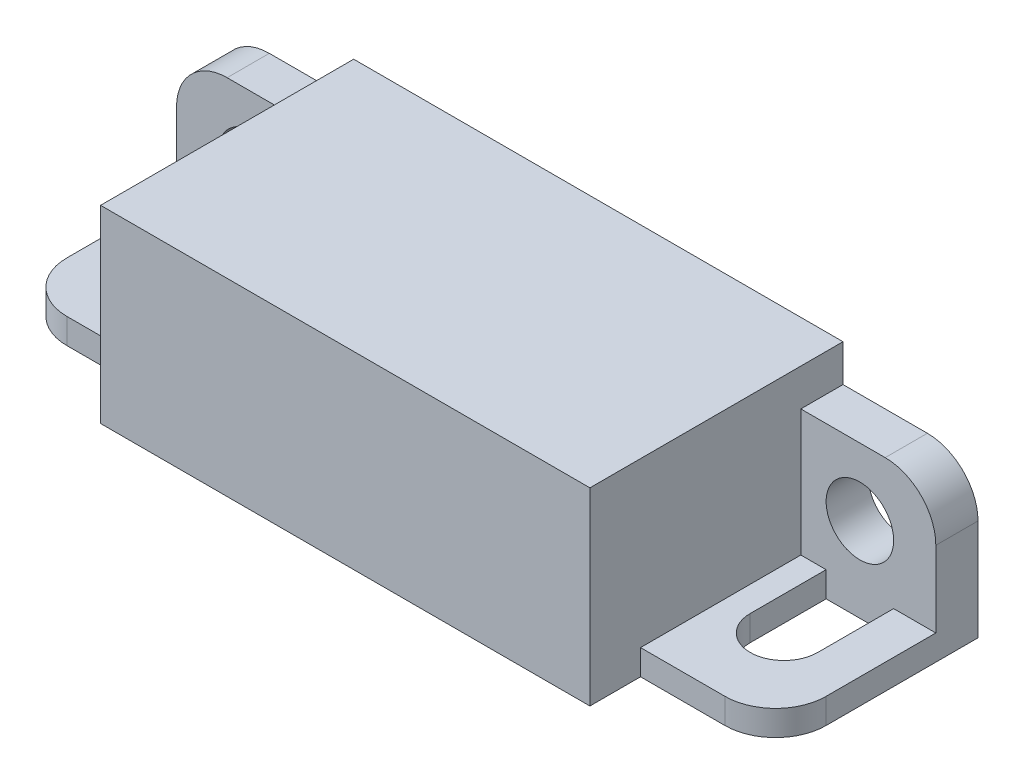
ISO-10303-21;
HEADER;
FILE_DESCRIPTION(('STEP AP214'),'2;1');
FILE_NAME('part.step','',(''),(''),'','','');
FILE_SCHEMA(('AUTOMOTIVE_DESIGN { 1 0 10303 214 1 1 1 1 }'));
ENDSEC;
DATA;
#1=APPLICATION_CONTEXT('core data for automotive mechanical design processes');
#2=APPLICATION_PROTOCOL_DEFINITION('international standard','automotive_design',2000,#1);
#3=PRODUCT_CONTEXT('',#1,'mechanical');
#4=PRODUCT('Part','Part','',(#3));
#5=PRODUCT_RELATED_PRODUCT_CATEGORY('part','',(#4));
#6=PRODUCT_DEFINITION_FORMATION('','',#4);
#7=PRODUCT_DEFINITION_CONTEXT('part definition',#1,'design');
#8=PRODUCT_DEFINITION('design','',#6,#7);
#9=PRODUCT_DEFINITION_SHAPE('','',#8);
#10=(LENGTH_UNIT() NAMED_UNIT(*) SI_UNIT(.MILLI.,.METRE.));
#11=(NAMED_UNIT(*) PLANE_ANGLE_UNIT() SI_UNIT($,.RADIAN.));
#12=(NAMED_UNIT(*) SI_UNIT($,.STERADIAN.) SOLID_ANGLE_UNIT());
#13=UNCERTAINTY_MEASURE_WITH_UNIT(LENGTH_MEASURE(1.E-05),#10,'distance_accuracy_value','');
#14=(GEOMETRIC_REPRESENTATION_CONTEXT(3) GLOBAL_UNCERTAINTY_ASSIGNED_CONTEXT((#13)) GLOBAL_UNIT_ASSIGNED_CONTEXT((#10,
#11,#12)) REPRESENTATION_CONTEXT('',''));
#15=CARTESIAN_POINT('',(0.,0.,0.));
#16=DIRECTION('',(0.,0.,1.));
#17=DIRECTION('',(1.,0.,0.));
#18=AXIS2_PLACEMENT_3D('',#15,#16,#17);
#19=CARTESIAN_POINT('',(18.,5.,15.));
#20=DIRECTION('',(0.,0.,1.));
#21=DIRECTION('',(1.,0.,0.));
#22=AXIS2_PLACEMENT_3D('',#19,#20,#21);
#23=CYLINDRICAL_SURFACE('',#22,2.);
#24=CARTESIAN_POINT('',(18.,5.,2.5));
#25=DIRECTION('',(0.,0.,1.));
#26=DIRECTION('',(1.,0.,0.));
#27=AXIS2_PLACEMENT_3D('',#24,#25,#26);
#28=CIRCLE('',#27,2.);
#29=CARTESIAN_POINT('',(20.,5.,2.5));
#30=VERTEX_POINT('',#29);
#31=EDGE_CURVE('E18',#30,#30,#28,.F.);
#32=ORIENTED_EDGE('',*,*,#31,.F.);
#33=EDGE_LOOP('',(#32));
#34=FACE_BOUND('',#33,.T.);
#35=CARTESIAN_POINT('',(18.,5.,0.));
#36=DIRECTION('',(0.,0.,1.));
#37=DIRECTION('',(1.,0.,0.));
#38=AXIS2_PLACEMENT_3D('',#35,#36,#37);
#39=CIRCLE('',#38,2.);
#40=CARTESIAN_POINT('',(20.,5.,0.));
#41=VERTEX_POINT('',#40);
#42=EDGE_CURVE('E374',#41,#41,#39,.F.);
#43=ORIENTED_EDGE('',*,*,#42,.T.);
#44=EDGE_LOOP('',(#43));
#45=FACE_BOUND('',#44,.T.);
#46=ADVANCED_FACE('F15',(#34,#45),#23,.F.);
#47=CARTESIAN_POINT('',(14.5,11.2,15.));
#48=DIRECTION('',(0.,-1.,0.));
#49=DIRECTION('',(0.,0.,-1.));
#50=AXIS2_PLACEMENT_3D('',#47,#48,#49);
#51=PLANE('',#50);
#52=DIRECTION('',(0.,0.,-1.));
#53=VECTOR('',#52,1.);
#54=CARTESIAN_POINT('',(-14.5,11.2,15.));
#55=LINE('',#54,#53);
#56=CARTESIAN_POINT('',(-14.5,11.2,0.));
#57=VERTEX_POINT('',#56);
#58=CARTESIAN_POINT('',(-14.5,11.2,15.));
#59=VERTEX_POINT('',#58);
#60=EDGE_CURVE('E304',#57,#59,#55,.F.);
#61=ORIENTED_EDGE('',*,*,#60,.T.);
#62=DIRECTION('',(1.,0.,0.));
#63=VECTOR('',#62,1.);
#64=CARTESIAN_POINT('',(-19.5,11.2,15.));
#65=LINE('',#64,#63);
#66=CARTESIAN_POINT('',(14.5,11.2,15.));
#67=VERTEX_POINT('',#66);
#68=EDGE_CURVE('E247',#67,#59,#65,.F.);
#69=ORIENTED_EDGE('',*,*,#68,.F.);
#70=DIRECTION('',(0.,0.,1.));
#71=VECTOR('',#70,1.);
#72=CARTESIAN_POINT('',(14.5,11.2,15.));
#73=LINE('',#72,#71);
#74=CARTESIAN_POINT('',(14.5,11.2,0.));
#75=VERTEX_POINT('',#74);
#76=EDGE_CURVE('E290',#67,#75,#73,.F.);
#77=ORIENTED_EDGE('',*,*,#76,.T.);
#78=DIRECTION('',(1.,0.,0.));
#79=VECTOR('',#78,1.);
#80=CARTESIAN_POINT('',(-19.5,11.2,0.));
#81=LINE('',#80,#79);
#82=EDGE_CURVE('E320',#75,#57,#81,.F.);
#83=ORIENTED_EDGE('',*,*,#82,.T.);
#84=EDGE_LOOP('',(#61,#69,#77,#83));
#85=FACE_BOUND('',#84,.T.);
#86=ADVANCED_FACE('F394',(#85),#51,.F.);
#87=CARTESIAN_POINT('',(19.5,9.,15.));
#88=DIRECTION('',(0.,-1.,0.));
#89=DIRECTION('',(0.,0.,-1.));
#90=AXIS2_PLACEMENT_3D('',#87,#88,#89);
#91=PLANE('',#90);
#92=DIRECTION('',(0.,0.,1.));
#93=VECTOR('',#92,1.);
#94=CARTESIAN_POINT('',(19.5,9.,15.));
#95=LINE('',#94,#93);
#96=CARTESIAN_POINT('',(19.5,9.,0.));
#97=VERTEX_POINT('',#96);
#98=CARTESIAN_POINT('',(19.5,9.,2.5));
#99=VERTEX_POINT('',#98);
#100=EDGE_CURVE('E229',#97,#99,#95,.T.);
#101=ORIENTED_EDGE('',*,*,#100,.F.);
#102=DIRECTION('',(1.,0.,0.));
#103=VECTOR('',#102,1.);
#104=CARTESIAN_POINT('',(-19.5,9.,0.));
#105=LINE('',#104,#103);
#106=CARTESIAN_POINT('',(14.5,9.,0.));
#107=VERTEX_POINT('',#106);
#108=EDGE_CURVE('E155',#97,#107,#105,.F.);
#109=ORIENTED_EDGE('',*,*,#108,.T.);
#110=DIRECTION('',(0.,0.,1.));
#111=VECTOR('',#110,1.);
#112=CARTESIAN_POINT('',(14.5,9.,15.));
#113=LINE('',#112,#111);
#114=CARTESIAN_POINT('',(14.5,9.,2.5));
#115=VERTEX_POINT('',#114);
#116=EDGE_CURVE('E301',#107,#115,#113,.T.);
#117=ORIENTED_EDGE('',*,*,#116,.T.);
#118=DIRECTION('',(1.,0.,0.));
#119=VECTOR('',#118,1.);
#120=CARTESIAN_POINT('',(29.5,9.,2.5));
#121=LINE('',#120,#119);
#122=EDGE_CURVE('E145',#99,#115,#121,.F.);
#123=ORIENTED_EDGE('',*,*,#122,.F.);
#124=EDGE_LOOP('',(#101,#109,#117,#123));
#125=FACE_BOUND('',#124,.T.);
#126=ADVANCED_FACE('F381',(#125),#91,.F.);
#127=CARTESIAN_POINT('',(19.5,6.,15.));
#128=DIRECTION('',(0.,0.,1.));
#129=DIRECTION('',(1.,0.,0.));
#130=AXIS2_PLACEMENT_3D('',#127,#128,#129);
#131=CYLINDRICAL_SURFACE('',#130,3.);
#132=CARTESIAN_POINT('',(19.5,6.,0.));
#133=DIRECTION('',(0.,0.,1.));
#134=DIRECTION('',(1.,0.,0.));
#135=AXIS2_PLACEMENT_3D('',#132,#133,#134);
#136=CIRCLE('',#135,3.);
#137=CARTESIAN_POINT('',(22.5,6.,0.));
#138=VERTEX_POINT('',#137);
#139=EDGE_CURVE('E371',#138,#97,#136,.T.);
#140=ORIENTED_EDGE('',*,*,#139,.T.);
#141=ORIENTED_EDGE('',*,*,#100,.T.);
#142=CARTESIAN_POINT('',(19.5,6.,2.5));
#143=DIRECTION('',(0.,0.,1.));
#144=DIRECTION('',(1.,0.,0.));
#145=AXIS2_PLACEMENT_3D('',#142,#143,#144);
#146=CIRCLE('',#145,3.);
#147=CARTESIAN_POINT('',(22.5,6.,2.5));
#148=VERTEX_POINT('',#147);
#149=EDGE_CURVE('E119',#148,#99,#146,.T.);
#150=ORIENTED_EDGE('',*,*,#149,.F.);
#151=DIRECTION('',(0.,0.,1.));
#152=VECTOR('',#151,1.);
#153=CARTESIAN_POINT('',(22.5,6.,15.));
#154=LINE('',#153,#152);
#155=EDGE_CURVE('E264',#148,#138,#154,.F.);
#156=ORIENTED_EDGE('',*,*,#155,.T.);
#157=EDGE_LOOP('',(#140,#141,#150,#156));
#158=FACE_BOUND('',#157,.T.);
#159=ADVANCED_FACE('F788',(#158),#131,.T.);
#160=CARTESIAN_POINT('',(29.5,1.5,22.5));
#161=DIRECTION('',(0.,1.,0.));
#162=DIRECTION('',(0.,0.,1.));
#163=AXIS2_PLACEMENT_3D('',#160,#161,#162);
#164=PLANE('',#163);
#165=DIRECTION('',(1.,0.,0.));
#166=VECTOR('',#165,1.);
#167=CARTESIAN_POINT('',(29.5,1.5,2.5));
#168=LINE('',#167,#166);
#169=CARTESIAN_POINT('',(20.,1.5,2.5));
#170=VERTEX_POINT('',#169);
#171=CARTESIAN_POINT('',(22.5,1.5,2.5));
#172=VERTEX_POINT('',#171);
#173=EDGE_CURVE('E127',#170,#172,#168,.T.);
#174=ORIENTED_EDGE('',*,*,#173,.F.);
#175=DIRECTION('',(0.,0.,1.));
#176=VECTOR('',#175,1.);
#177=CARTESIAN_POINT('',(20.,1.5,7.));
#178=LINE('',#177,#176);
#179=CARTESIAN_POINT('',(20.,1.5,7.));
#180=VERTEX_POINT('',#179);
#181=EDGE_CURVE('E174',#180,#170,#178,.F.);
#182=ORIENTED_EDGE('',*,*,#181,.F.);
#183=CARTESIAN_POINT('',(18.,1.5,7.));
#184=DIRECTION('',(0.,1.,0.));
#185=DIRECTION('',(0.,0.,1.));
#186=AXIS2_PLACEMENT_3D('',#183,#184,#185);
#187=CIRCLE('',#186,2.);
#188=CARTESIAN_POINT('',(16.,1.5,7.));
#189=VERTEX_POINT('',#188);
#190=EDGE_CURVE('E196',#180,#189,#187,.F.);
#191=ORIENTED_EDGE('',*,*,#190,.T.);
#192=DIRECTION('',(0.,0.,-1.));
#193=VECTOR('',#192,1.);
#194=CARTESIAN_POINT('',(16.,1.5,2.5));
#195=LINE('',#194,#193);
#196=CARTESIAN_POINT('',(16.,1.5,2.5));
#197=VERTEX_POINT('',#196);
#198=EDGE_CURVE('E334',#197,#189,#195,.F.);
#199=ORIENTED_EDGE('',*,*,#198,.F.);
#200=DIRECTION('',(1.,0.,0.));
#201=VECTOR('',#200,1.);
#202=CARTESIAN_POINT('',(29.5,1.5,2.5));
#203=LINE('',#202,#201);
#204=CARTESIAN_POINT('',(14.5,1.5,2.5));
#205=VERTEX_POINT('',#204);
#206=EDGE_CURVE('E201',#205,#197,#203,.T.);
#207=ORIENTED_EDGE('',*,*,#206,.F.);
#208=DIRECTION('',(0.,0.,1.));
#209=VECTOR('',#208,1.);
#210=CARTESIAN_POINT('',(14.5,1.5,15.));
#211=LINE('',#210,#209);
#212=CARTESIAN_POINT('',(14.5,1.5,12.));
#213=VERTEX_POINT('',#212);
#214=EDGE_CURVE('E280',#205,#213,#211,.T.);
#215=ORIENTED_EDGE('',*,*,#214,.T.);
#216=DIRECTION('',(-1.,0.,0.));
#217=VECTOR('',#216,1.);
#218=CARTESIAN_POINT('',(14.5,1.5,12.));
#219=LINE('',#218,#217);
#220=CARTESIAN_POINT('',(19.5,1.5,12.));
#221=VERTEX_POINT('',#220);
#222=EDGE_CURVE('E273',#213,#221,#219,.F.);
#223=ORIENTED_EDGE('',*,*,#222,.T.);
#224=CARTESIAN_POINT('',(19.5,1.5,9.));
#225=DIRECTION('',(0.,1.,0.));
#226=DIRECTION('',(0.,0.,1.));
#227=AXIS2_PLACEMENT_3D('',#224,#225,#226);
#228=CIRCLE('',#227,3.);
#229=CARTESIAN_POINT('',(22.5,1.5,9.));
#230=VERTEX_POINT('',#229);
#231=EDGE_CURVE('E276',#230,#221,#228,.F.);
#232=ORIENTED_EDGE('',*,*,#231,.F.);
#233=DIRECTION('',(0.,0.,1.));
#234=VECTOR('',#233,1.);
#235=CARTESIAN_POINT('',(22.5,1.5,15.));
#236=LINE('',#235,#234);
#237=EDGE_CURVE('E256',#230,#172,#236,.F.);
#238=ORIENTED_EDGE('',*,*,#237,.T.);
#239=EDGE_LOOP('',(#174,#182,#191,#199,#207,#215,#223,#232,#238));
#240=FACE_BOUND('',#239,.T.);
#241=ADVANCED_FACE('F445',(#240),#164,.T.);
#242=CARTESIAN_POINT('',(-18.,5.,15.));
#243=DIRECTION('',(0.,0.,1.));
#244=DIRECTION('',(1.,0.,0.));
#245=AXIS2_PLACEMENT_3D('',#242,#243,#244);
#246=CYLINDRICAL_SURFACE('',#245,2.);
#247=CARTESIAN_POINT('',(-18.,5.,0.));
#248=DIRECTION('',(0.,0.,1.));
#249=DIRECTION('',(1.,0.,0.));
#250=AXIS2_PLACEMENT_3D('',#247,#248,#249);
#251=CIRCLE('',#250,2.);
#252=CARTESIAN_POINT('',(-16.,5.,0.));
#253=VERTEX_POINT('',#252);
#254=EDGE_CURVE('E377',#253,#253,#251,.F.);
#255=ORIENTED_EDGE('',*,*,#254,.T.);
#256=EDGE_LOOP('',(#255));
#257=FACE_BOUND('',#256,.T.);
#258=CARTESIAN_POINT('',(-18.,5.,2.5));
#259=DIRECTION('',(0.,0.,1.));
#260=DIRECTION('',(1.,0.,0.));
#261=AXIS2_PLACEMENT_3D('',#258,#259,#260);
#262=CIRCLE('',#261,2.);
#263=CARTESIAN_POINT('',(-16.,5.,2.5));
#264=VERTEX_POINT('',#263);
#265=EDGE_CURVE('E232',#264,#264,#262,.T.);
#266=ORIENTED_EDGE('',*,*,#265,.T.);
#267=EDGE_LOOP('',(#266));
#268=FACE_BOUND('',#267,.T.);
#269=ADVANCED_FACE('F601',(#257,#268),#246,.F.);
#270=CARTESIAN_POINT('',(-19.5,6.,15.));
#271=DIRECTION('',(0.,0.,1.));
#272=DIRECTION('',(1.,0.,0.));
#273=AXIS2_PLACEMENT_3D('',#270,#271,#272);
#274=CYLINDRICAL_SURFACE('',#273,3.);
#275=DIRECTION('',(0.,0.,-1.));
#276=VECTOR('',#275,1.);
#277=CARTESIAN_POINT('',(-19.5,9.,15.));
#278=LINE('',#277,#276);
#279=CARTESIAN_POINT('',(-19.5,9.,2.5));
#280=VERTEX_POINT('',#279);
#281=CARTESIAN_POINT('',(-19.5,9.,0.));
#282=VERTEX_POINT('',#281);
#283=EDGE_CURVE('E227',#280,#282,#278,.T.);
#284=ORIENTED_EDGE('',*,*,#283,.T.);
#285=CARTESIAN_POINT('',(-19.5,6.,0.));
#286=DIRECTION('',(0.,0.,1.));
#287=DIRECTION('',(1.,0.,0.));
#288=AXIS2_PLACEMENT_3D('',#285,#286,#287);
#289=CIRCLE('',#288,3.);
#290=CARTESIAN_POINT('',(-22.5,6.,0.));
#291=VERTEX_POINT('',#290);
#292=EDGE_CURVE('E369',#282,#291,#289,.T.);
#293=ORIENTED_EDGE('',*,*,#292,.T.);
#294=DIRECTION('',(0.,0.,-1.));
#295=VECTOR('',#294,1.);
#296=CARTESIAN_POINT('',(-22.5,6.,15.));
#297=LINE('',#296,#295);
#298=CARTESIAN_POINT('',(-22.5,6.,2.5));
#299=VERTEX_POINT('',#298);
#300=EDGE_CURVE('E235',#291,#299,#297,.F.);
#301=ORIENTED_EDGE('',*,*,#300,.T.);
#302=CARTESIAN_POINT('',(-19.5,6.,2.5));
#303=DIRECTION('',(0.,0.,1.));
#304=DIRECTION('',(1.,0.,0.));
#305=AXIS2_PLACEMENT_3D('',#302,#303,#304);
#306=CIRCLE('',#305,3.);
#307=EDGE_CURVE('E361',#299,#280,#306,.F.);
#308=ORIENTED_EDGE('',*,*,#307,.T.);
#309=EDGE_LOOP('',(#284,#293,#301,#308));
#310=FACE_BOUND('',#309,.T.);
#311=ADVANCED_FACE('F599',(#310),#274,.T.);
#312=CARTESIAN_POINT('',(-14.5,9.,15.));
#313=DIRECTION('',(0.,-1.,0.));
#314=DIRECTION('',(0.,0.,-1.));
#315=AXIS2_PLACEMENT_3D('',#312,#313,#314);
#316=PLANE('',#315);
#317=DIRECTION('',(-1.,0.,0.));
#318=VECTOR('',#317,1.);
#319=CARTESIAN_POINT('',(-29.5,9.,2.5));
#320=LINE('',#319,#318);
#321=CARTESIAN_POINT('',(-14.5,9.,2.5));
#322=VERTEX_POINT('',#321);
#323=EDGE_CURVE('E219',#280,#322,#320,.F.);
#324=ORIENTED_EDGE('',*,*,#323,.T.);
#325=DIRECTION('',(0.,0.,-1.));
#326=VECTOR('',#325,1.);
#327=CARTESIAN_POINT('',(-14.5,9.,15.));
#328=LINE('',#327,#326);
#329=CARTESIAN_POINT('',(-14.5,9.,0.));
#330=VERTEX_POINT('',#329);
#331=EDGE_CURVE('E244',#322,#330,#328,.T.);
#332=ORIENTED_EDGE('',*,*,#331,.T.);
#333=DIRECTION('',(1.,0.,0.));
#334=VECTOR('',#333,1.);
#335=CARTESIAN_POINT('',(-19.5,9.,0.));
#336=LINE('',#335,#334);
#337=EDGE_CURVE('E323',#330,#282,#336,.F.);
#338=ORIENTED_EDGE('',*,*,#337,.T.);
#339=ORIENTED_EDGE('',*,*,#283,.F.);
#340=EDGE_LOOP('',(#324,#332,#338,#339));
#341=FACE_BOUND('',#340,.T.);
#342=ADVANCED_FACE('F530',(#341),#316,.F.);
#343=CARTESIAN_POINT('',(-29.5,1.5,22.5));
#344=DIRECTION('',(0.,-1.,0.));
#345=DIRECTION('',(0.,0.,-1.));
#346=AXIS2_PLACEMENT_3D('',#343,#344,#345);
#347=PLANE('',#346);
#348=DIRECTION('',(-1.,0.,0.));
#349=VECTOR('',#348,1.);
#350=CARTESIAN_POINT('',(-29.5,1.5,2.5));
#351=LINE('',#350,#349);
#352=CARTESIAN_POINT('',(-20.,1.5,2.5));
#353=VERTEX_POINT('',#352);
#354=CARTESIAN_POINT('',(-22.5,1.5,2.5));
#355=VERTEX_POINT('',#354);
#356=EDGE_CURVE('E208',#353,#355,#351,.T.);
#357=ORIENTED_EDGE('',*,*,#356,.T.);
#358=DIRECTION('',(0.,0.,-1.));
#359=VECTOR('',#358,1.);
#360=CARTESIAN_POINT('',(-22.5,1.5,15.));
#361=LINE('',#360,#359);
#362=CARTESIAN_POINT('',(-22.5,1.5,9.));
#363=VERTEX_POINT('',#362);
#364=EDGE_CURVE('E237',#355,#363,#361,.F.);
#365=ORIENTED_EDGE('',*,*,#364,.T.);
#366=CARTESIAN_POINT('',(-19.5,1.5,9.));
#367=DIRECTION('',(0.,1.,0.));
#368=DIRECTION('',(0.,0.,1.));
#369=AXIS2_PLACEMENT_3D('',#366,#367,#368);
#370=CIRCLE('',#369,3.);
#371=CARTESIAN_POINT('',(-19.5,1.5,12.));
#372=VERTEX_POINT('',#371);
#373=EDGE_CURVE('E241',#372,#363,#370,.F.);
#374=ORIENTED_EDGE('',*,*,#373,.F.);
#375=DIRECTION('',(-1.,0.,0.));
#376=VECTOR('',#375,1.);
#377=CARTESIAN_POINT('',(-19.5,1.5,12.));
#378=LINE('',#377,#376);
#379=CARTESIAN_POINT('',(-14.5,1.5,12.));
#380=VERTEX_POINT('',#379);
#381=EDGE_CURVE('E312',#372,#380,#378,.F.);
#382=ORIENTED_EDGE('',*,*,#381,.T.);
#383=DIRECTION('',(0.,0.,-1.));
#384=VECTOR('',#383,1.);
#385=CARTESIAN_POINT('',(-14.5,1.5,15.));
#386=LINE('',#385,#384);
#387=CARTESIAN_POINT('',(-14.5,1.5,2.5));
#388=VERTEX_POINT('',#387);
#389=EDGE_CURVE('E248',#380,#388,#386,.T.);
#390=ORIENTED_EDGE('',*,*,#389,.T.);
#391=DIRECTION('',(-1.,0.,0.));
#392=VECTOR('',#391,1.);
#393=CARTESIAN_POINT('',(-29.5,1.5,2.5));
#394=LINE('',#393,#392);
#395=CARTESIAN_POINT('',(-16.,1.5,2.5));
#396=VERTEX_POINT('',#395);
#397=EDGE_CURVE('E212',#388,#396,#394,.T.);
#398=ORIENTED_EDGE('',*,*,#397,.T.);
#399=DIRECTION('',(0.,0.,1.));
#400=VECTOR('',#399,1.);
#401=CARTESIAN_POINT('',(-16.,1.5,7.));
#402=LINE('',#401,#400);
#403=CARTESIAN_POINT('',(-16.,1.5,7.));
#404=VERTEX_POINT('',#403);
#405=EDGE_CURVE('E215',#404,#396,#402,.F.);
#406=ORIENTED_EDGE('',*,*,#405,.F.);
#407=CARTESIAN_POINT('',(-18.,1.5,7.));
#408=DIRECTION('',(0.,1.,0.));
#409=DIRECTION('',(0.,0.,1.));
#410=AXIS2_PLACEMENT_3D('',#407,#408,#409);
#411=CIRCLE('',#410,2.);
#412=CARTESIAN_POINT('',(-20.,1.5,7.));
#413=VERTEX_POINT('',#412);
#414=EDGE_CURVE('E357',#404,#413,#411,.F.);
#415=ORIENTED_EDGE('',*,*,#414,.T.);
#416=DIRECTION('',(0.,0.,-1.));
#417=VECTOR('',#416,1.);
#418=CARTESIAN_POINT('',(-20.,1.5,2.5));
#419=LINE('',#418,#417);
#420=EDGE_CURVE('E188',#353,#413,#419,.F.);
#421=ORIENTED_EDGE('',*,*,#420,.F.);
#422=EDGE_LOOP('',(#357,#365,#374,#382,#390,#398,#406,#415,#421));
#423=FACE_BOUND('',#422,.T.);
#424=ADVANCED_FACE('F541',(#423),#347,.F.);
#425=CARTESIAN_POINT('',(29.5,1.5,2.5));
#426=DIRECTION('',(0.,0.,1.));
#427=DIRECTION('',(1.,0.,0.));
#428=AXIS2_PLACEMENT_3D('',#425,#426,#427);
#429=PLANE('',#428);
#430=DIRECTION('',(0.,1.,0.));
#431=VECTOR('',#430,1.);
#432=CARTESIAN_POINT('',(22.5,0.,2.5));
#433=LINE('',#432,#431);
#434=EDGE_CURVE('E262',#172,#148,#433,.T.);
#435=ORIENTED_EDGE('',*,*,#434,.T.);
#436=ORIENTED_EDGE('',*,*,#149,.T.);
#437=ORIENTED_EDGE('',*,*,#122,.T.);
#438=DIRECTION('',(0.,1.,0.));
#439=VECTOR('',#438,1.);
#440=CARTESIAN_POINT('',(14.5,9.,2.5));
#441=LINE('',#440,#439);
#442=EDGE_CURVE('E299',#115,#205,#441,.F.);
#443=ORIENTED_EDGE('',*,*,#442,.T.);
#444=ORIENTED_EDGE('',*,*,#206,.T.);
#445=DIRECTION('',(0.,1.,0.));
#446=VECTOR('',#445,1.);
#447=CARTESIAN_POINT('',(16.,15.,2.5));
#448=LINE('',#447,#446);
#449=CARTESIAN_POINT('',(16.,0.,2.5));
#450=VERTEX_POINT('',#449);
#451=EDGE_CURVE('E185',#450,#197,#448,.T.);
#452=ORIENTED_EDGE('',*,*,#451,.F.);
#453=DIRECTION('',(1.,0.,0.));
#454=VECTOR('',#453,1.);
#455=CARTESIAN_POINT('',(-22.5,0.,2.5));
#456=LINE('',#455,#454);
#457=CARTESIAN_POINT('',(20.,0.,2.5));
#458=VERTEX_POINT('',#457);
#459=EDGE_CURVE('E165',#450,#458,#456,.T.);
#460=ORIENTED_EDGE('',*,*,#459,.T.);
#461=DIRECTION('',(0.,1.,0.));
#462=VECTOR('',#461,1.);
#463=CARTESIAN_POINT('',(20.,15.,2.5));
#464=LINE('',#463,#462);
#465=EDGE_CURVE('E170',#170,#458,#464,.F.);
#466=ORIENTED_EDGE('',*,*,#465,.F.);
#467=ORIENTED_EDGE('',*,*,#173,.T.);
#468=EDGE_LOOP('',(#435,#436,#437,#443,#444,#452,#460,#466,#467));
#469=FACE_BOUND('',#468,.T.);
#470=ORIENTED_EDGE('',*,*,#31,.T.);
#471=EDGE_LOOP('',(#470));
#472=FACE_BOUND('',#471,.T.);
#473=ADVANCED_FACE('F182',(#469,#472),#429,.T.);
#474=CARTESIAN_POINT('',(20.,15.,7.));
#475=DIRECTION('',(-1.,0.,0.));
#476=DIRECTION('',(0.,0.,1.));
#477=AXIS2_PLACEMENT_3D('',#474,#475,#476);
#478=PLANE('',#477);
#479=ORIENTED_EDGE('',*,*,#181,.T.);
#480=ORIENTED_EDGE('',*,*,#465,.T.);
#481=DIRECTION('',(0.,0.,1.));
#482=VECTOR('',#481,1.);
#483=CARTESIAN_POINT('',(20.,0.,15.));
#484=LINE('',#483,#482);
#485=CARTESIAN_POINT('',(20.,0.,7.));
#486=VERTEX_POINT('',#485);
#487=EDGE_CURVE('E173',#458,#486,#484,.T.);
#488=ORIENTED_EDGE('',*,*,#487,.T.);
#489=DIRECTION('',(0.,1.,0.));
#490=VECTOR('',#489,1.);
#491=CARTESIAN_POINT('',(20.,15.,7.));
#492=LINE('',#491,#490);
#493=EDGE_CURVE('E175',#486,#180,#492,.T.);
#494=ORIENTED_EDGE('',*,*,#493,.T.);
#495=EDGE_LOOP('',(#479,#480,#488,#494));
#496=FACE_BOUND('',#495,.T.);
#497=ADVANCED_FACE('F171',(#496),#478,.T.);
#498=CARTESIAN_POINT('',(18.,15.,7.));
#499=DIRECTION('',(0.,1.,0.));
#500=DIRECTION('',(0.,0.,1.));
#501=AXIS2_PLACEMENT_3D('',#498,#499,#500);
#502=CYLINDRICAL_SURFACE('',#501,2.);
#503=DIRECTION('',(0.,1.,0.));
#504=VECTOR('',#503,1.);
#505=CARTESIAN_POINT('',(16.,15.,7.));
#506=LINE('',#505,#504);
#507=CARTESIAN_POINT('',(16.,0.,7.));
#508=VERTEX_POINT('',#507);
#509=EDGE_CURVE('E336',#189,#508,#506,.F.);
#510=ORIENTED_EDGE('',*,*,#509,.F.);
#511=ORIENTED_EDGE('',*,*,#190,.F.);
#512=ORIENTED_EDGE('',*,*,#493,.F.);
#513=CARTESIAN_POINT('',(18.,0.,7.));
#514=DIRECTION('',(0.,1.,0.));
#515=DIRECTION('',(0.,0.,1.));
#516=AXIS2_PLACEMENT_3D('',#513,#514,#515);
#517=CIRCLE('',#516,2.);
#518=EDGE_CURVE('E180',#486,#508,#517,.F.);
#519=ORIENTED_EDGE('',*,*,#518,.T.);
#520=EDGE_LOOP('',(#510,#511,#512,#519));
#521=FACE_BOUND('',#520,.T.);
#522=ADVANCED_FACE('F449',(#521),#502,.F.);
#523=CARTESIAN_POINT('',(16.,15.,2.5));
#524=DIRECTION('',(1.,0.,0.));
#525=DIRECTION('',(0.,0.,-1.));
#526=AXIS2_PLACEMENT_3D('',#523,#524,#525);
#527=PLANE('',#526);
#528=ORIENTED_EDGE('',*,*,#198,.T.);
#529=ORIENTED_EDGE('',*,*,#509,.T.);
#530=DIRECTION('',(0.,0.,1.));
#531=VECTOR('',#530,1.);
#532=CARTESIAN_POINT('',(16.,0.,15.));
#533=LINE('',#532,#531);
#534=EDGE_CURVE('E356',#508,#450,#533,.F.);
#535=ORIENTED_EDGE('',*,*,#534,.T.);
#536=ORIENTED_EDGE('',*,*,#451,.T.);
#537=EDGE_LOOP('',(#528,#529,#535,#536));
#538=FACE_BOUND('',#537,.T.);
#539=ADVANCED_FACE('F442',(#538),#527,.T.);
#540=CARTESIAN_POINT('',(-19.5,6.,0.));
#541=DIRECTION('',(0.,0.,1.));
#542=DIRECTION('',(1.,0.,0.));
#543=AXIS2_PLACEMENT_3D('',#540,#541,#542);
#544=PLANE('',#543);
#545=ORIENTED_EDGE('',*,*,#337,.F.);
#546=DIRECTION('',(0.,1.,0.));
#547=VECTOR('',#546,1.);
#548=CARTESIAN_POINT('',(-14.5,11.2,0.));
#549=LINE('',#548,#547);
#550=EDGE_CURVE('E307',#330,#57,#549,.T.);
#551=ORIENTED_EDGE('',*,*,#550,.T.);
#552=ORIENTED_EDGE('',*,*,#82,.F.);
#553=DIRECTION('',(0.,1.,0.));
#554=VECTOR('',#553,1.);
#555=CARTESIAN_POINT('',(14.5,9.,0.));
#556=LINE('',#555,#554);
#557=EDGE_CURVE('E293',#75,#107,#556,.F.);
#558=ORIENTED_EDGE('',*,*,#557,.T.);
#559=ORIENTED_EDGE('',*,*,#108,.F.);
#560=ORIENTED_EDGE('',*,*,#139,.F.);
#561=DIRECTION('',(0.,1.,0.));
#562=VECTOR('',#561,1.);
#563=CARTESIAN_POINT('',(22.5,0.,0.));
#564=LINE('',#563,#562);
#565=CARTESIAN_POINT('',(22.5,0.,0.));
#566=VERTEX_POINT('',#565);
#567=EDGE_CURVE('E269',#138,#566,#564,.F.);
#568=ORIENTED_EDGE('',*,*,#567,.T.);
#569=DIRECTION('',(1.,0.,0.));
#570=VECTOR('',#569,1.);
#571=CARTESIAN_POINT('',(-22.5,0.,0.));
#572=LINE('',#571,#570);
#573=CARTESIAN_POINT('',(-22.5,0.,0.));
#574=VERTEX_POINT('',#573);
#575=EDGE_CURVE('E450',#566,#574,#572,.F.);
#576=ORIENTED_EDGE('',*,*,#575,.T.);
#577=DIRECTION('',(0.,1.,0.));
#578=VECTOR('',#577,1.);
#579=CARTESIAN_POINT('',(-22.5,6.,0.));
#580=LINE('',#579,#578);
#581=EDGE_CURVE('E238',#574,#291,#580,.T.);
#582=ORIENTED_EDGE('',*,*,#581,.T.);
#583=ORIENTED_EDGE('',*,*,#292,.F.);
#584=EDGE_LOOP('',(#545,#551,#552,#558,#559,#560,#568,#576,#582,#583));
#585=FACE_BOUND('',#584,.T.);
#586=ORIENTED_EDGE('',*,*,#42,.F.);
#587=EDGE_LOOP('',(#586));
#588=FACE_BOUND('',#587,.T.);
#589=ORIENTED_EDGE('',*,*,#254,.F.);
#590=EDGE_LOOP('',(#589));
#591=FACE_BOUND('',#590,.T.);
#592=ADVANCED_FACE('F388',(#585,#588,#591),#544,.F.);
#593=CARTESIAN_POINT('',(-22.5,6.,15.));
#594=DIRECTION('',(1.,0.,0.));
#595=DIRECTION('',(0.,0.,-1.));
#596=AXIS2_PLACEMENT_3D('',#593,#594,#595);
#597=PLANE('',#596);
#598=ORIENTED_EDGE('',*,*,#364,.F.);
#599=DIRECTION('',(0.,1.,0.));
#600=VECTOR('',#599,1.);
#601=CARTESIAN_POINT('',(-22.5,1.5,2.5));
#602=LINE('',#601,#600);
#603=EDGE_CURVE('E211',#355,#299,#602,.T.);
#604=ORIENTED_EDGE('',*,*,#603,.T.);
#605=ORIENTED_EDGE('',*,*,#300,.F.);
#606=ORIENTED_EDGE('',*,*,#581,.F.);
#607=DIRECTION('',(0.,0.,1.));
#608=VECTOR('',#607,1.);
#609=CARTESIAN_POINT('',(-22.5,0.,15.));
#610=LINE('',#609,#608);
#611=CARTESIAN_POINT('',(-22.5,0.,9.));
#612=VERTEX_POINT('',#611);
#613=EDGE_CURVE('E354',#574,#612,#610,.T.);
#614=ORIENTED_EDGE('',*,*,#613,.T.);
#615=DIRECTION('',(0.,1.,0.));
#616=VECTOR('',#615,1.);
#617=CARTESIAN_POINT('',(-22.5,15.,9.));
#618=LINE('',#617,#616);
#619=EDGE_CURVE('E368',#363,#612,#618,.F.);
#620=ORIENTED_EDGE('',*,*,#619,.F.);
#621=EDGE_LOOP('',(#598,#604,#605,#606,#614,#620));
#622=FACE_BOUND('',#621,.T.);
#623=ADVANCED_FACE('F570',(#622),#597,.F.);
#624=CARTESIAN_POINT('',(-19.5,15.,9.));
#625=DIRECTION('',(0.,1.,0.));
#626=DIRECTION('',(0.,0.,1.));
#627=AXIS2_PLACEMENT_3D('',#624,#625,#626);
#628=CYLINDRICAL_SURFACE('',#627,3.);
#629=ORIENTED_EDGE('',*,*,#619,.T.);
#630=CARTESIAN_POINT('',(-19.5,0.,9.));
#631=DIRECTION('',(0.,1.,0.));
#632=DIRECTION('',(0.,0.,1.));
#633=AXIS2_PLACEMENT_3D('',#630,#631,#632);
#634=CIRCLE('',#633,3.);
#635=CARTESIAN_POINT('',(-19.5,0.,12.));
#636=VERTEX_POINT('',#635);
#637=EDGE_CURVE('E350',#612,#636,#634,.T.);
#638=ORIENTED_EDGE('',*,*,#637,.T.);
#639=DIRECTION('',(0.,1.,0.));
#640=VECTOR('',#639,1.);
#641=CARTESIAN_POINT('',(-19.5,15.,12.));
#642=LINE('',#641,#640);
#643=EDGE_CURVE('E317',#636,#372,#642,.T.);
#644=ORIENTED_EDGE('',*,*,#643,.T.);
#645=ORIENTED_EDGE('',*,*,#373,.T.);
#646=EDGE_LOOP('',(#629,#638,#644,#645));
#647=FACE_BOUND('',#646,.T.);
#648=ADVANCED_FACE('F641',(#647),#628,.T.);
#649=CARTESIAN_POINT('',(-19.5,15.,12.));
#650=DIRECTION('',(0.,0.,-1.));
#651=DIRECTION('',(-1.,0.,0.));
#652=AXIS2_PLACEMENT_3D('',#649,#650,#651);
#653=PLANE('',#652);
#654=ORIENTED_EDGE('',*,*,#381,.F.);
#655=ORIENTED_EDGE('',*,*,#643,.F.);
#656=DIRECTION('',(1.,0.,0.));
#657=VECTOR('',#656,1.);
#658=CARTESIAN_POINT('',(-22.5,0.,12.));
#659=LINE('',#658,#657);
#660=CARTESIAN_POINT('',(-14.5,0.,12.));
#661=VERTEX_POINT('',#660);
#662=EDGE_CURVE('E353',#636,#661,#659,.T.);
#663=ORIENTED_EDGE('',*,*,#662,.T.);
#664=DIRECTION('',(0.,1.,0.));
#665=VECTOR('',#664,1.);
#666=CARTESIAN_POINT('',(-14.5,11.2,12.));
#667=LINE('',#666,#665);
#668=EDGE_CURVE('E253',#661,#380,#667,.T.);
#669=ORIENTED_EDGE('',*,*,#668,.T.);
#670=EDGE_LOOP('',(#654,#655,#663,#669));
#671=FACE_BOUND('',#670,.T.);
#672=ADVANCED_FACE('F638',(#671),#653,.F.);
#673=CARTESIAN_POINT('',(-14.5,11.2,15.));
#674=DIRECTION('',(1.,0.,0.));
#675=DIRECTION('',(0.,0.,-1.));
#676=AXIS2_PLACEMENT_3D('',#673,#674,#675);
#677=PLANE('',#676);
#678=DIRECTION('',(0.,1.,0.));
#679=VECTOR('',#678,1.);
#680=CARTESIAN_POINT('',(-14.5,1.5,2.5));
#681=LINE('',#680,#679);
#682=EDGE_CURVE('E224',#322,#388,#681,.F.);
#683=ORIENTED_EDGE('',*,*,#682,.T.);
#684=ORIENTED_EDGE('',*,*,#389,.F.);
#685=ORIENTED_EDGE('',*,*,#668,.F.);
#686=DIRECTION('',(0.,0.,1.));
#687=VECTOR('',#686,1.);
#688=CARTESIAN_POINT('',(-14.5,0.,15.));
#689=LINE('',#688,#687);
#690=CARTESIAN_POINT('',(-14.5,0.,15.));
#691=VERTEX_POINT('',#690);
#692=EDGE_CURVE('E406',#661,#691,#689,.T.);
#693=ORIENTED_EDGE('',*,*,#692,.T.);
#694=DIRECTION('',(0.,1.,0.));
#695=VECTOR('',#694,1.);
#696=CARTESIAN_POINT('',(-14.5,6.,15.));
#697=LINE('',#696,#695);
#698=EDGE_CURVE('E283',#59,#691,#697,.F.);
#699=ORIENTED_EDGE('',*,*,#698,.F.);
#700=ORIENTED_EDGE('',*,*,#60,.F.);
#701=ORIENTED_EDGE('',*,*,#550,.F.);
#702=ORIENTED_EDGE('',*,*,#331,.F.);
#703=EDGE_LOOP('',(#683,#684,#685,#693,#699,#700,#701,#702));
#704=FACE_BOUND('',#703,.T.);
#705=ADVANCED_FACE('F399',(#704),#677,.F.);
#706=CARTESIAN_POINT('',(-19.5,6.,15.));
#707=DIRECTION('',(0.,0.,1.));
#708=DIRECTION('',(1.,0.,0.));
#709=AXIS2_PLACEMENT_3D('',#706,#707,#708);
#710=PLANE('',#709);
#711=ORIENTED_EDGE('',*,*,#68,.T.);
#712=ORIENTED_EDGE('',*,*,#698,.T.);
#713=DIRECTION('',(1.,0.,0.));
#714=VECTOR('',#713,1.);
#715=CARTESIAN_POINT('',(-22.5,0.,15.));
#716=LINE('',#715,#714);
#717=CARTESIAN_POINT('',(14.5,0.,15.));
#718=VERTEX_POINT('',#717);
#719=EDGE_CURVE('E419',#691,#718,#716,.T.);
#720=ORIENTED_EDGE('',*,*,#719,.T.);
#721=DIRECTION('',(0.,1.,0.));
#722=VECTOR('',#721,1.);
#723=CARTESIAN_POINT('',(14.5,9.,15.));
#724=LINE('',#723,#722);
#725=EDGE_CURVE('E282',#718,#67,#724,.T.);
#726=ORIENTED_EDGE('',*,*,#725,.T.);
#727=EDGE_LOOP('',(#711,#712,#720,#726));
#728=FACE_BOUND('',#727,.T.);
#729=ADVANCED_FACE('F507',(#728),#710,.T.);
#730=CARTESIAN_POINT('',(14.5,9.,15.));
#731=DIRECTION('',(-1.,0.,0.));
#732=DIRECTION('',(0.,0.,1.));
#733=AXIS2_PLACEMENT_3D('',#730,#731,#732);
#734=PLANE('',#733);
#735=ORIENTED_EDGE('',*,*,#116,.F.);
#736=ORIENTED_EDGE('',*,*,#557,.F.);
#737=ORIENTED_EDGE('',*,*,#76,.F.);
#738=ORIENTED_EDGE('',*,*,#725,.F.);
#739=DIRECTION('',(0.,0.,1.));
#740=VECTOR('',#739,1.);
#741=CARTESIAN_POINT('',(14.5,0.,15.));
#742=LINE('',#741,#740);
#743=CARTESIAN_POINT('',(14.5,0.,12.));
#744=VERTEX_POINT('',#743);
#745=EDGE_CURVE('E498',#718,#744,#742,.F.);
#746=ORIENTED_EDGE('',*,*,#745,.T.);
#747=DIRECTION('',(0.,1.,0.));
#748=VECTOR('',#747,1.);
#749=CARTESIAN_POINT('',(14.5,15.,12.));
#750=LINE('',#749,#748);
#751=EDGE_CURVE('E277',#744,#213,#750,.T.);
#752=ORIENTED_EDGE('',*,*,#751,.T.);
#753=ORIENTED_EDGE('',*,*,#214,.F.);
#754=ORIENTED_EDGE('',*,*,#442,.F.);
#755=EDGE_LOOP('',(#735,#736,#737,#738,#746,#752,#753,#754));
#756=FACE_BOUND('',#755,.T.);
#757=ADVANCED_FACE('F384',(#756),#734,.F.);
#758=CARTESIAN_POINT('',(14.5,15.,12.));
#759=DIRECTION('',(0.,0.,-1.));
#760=DIRECTION('',(-1.,0.,0.));
#761=AXIS2_PLACEMENT_3D('',#758,#759,#760);
#762=PLANE('',#761);
#763=ORIENTED_EDGE('',*,*,#751,.F.);
#764=DIRECTION('',(1.,0.,0.));
#765=VECTOR('',#764,1.);
#766=CARTESIAN_POINT('',(-22.5,0.,12.));
#767=LINE('',#766,#765);
#768=CARTESIAN_POINT('',(19.5,0.,12.));
#769=VERTEX_POINT('',#768);
#770=EDGE_CURVE('E349',#744,#769,#767,.T.);
#771=ORIENTED_EDGE('',*,*,#770,.T.);
#772=DIRECTION('',(0.,1.,0.));
#773=VECTOR('',#772,1.);
#774=CARTESIAN_POINT('',(19.5,15.,12.));
#775=LINE('',#774,#773);
#776=EDGE_CURVE('E265',#221,#769,#775,.F.);
#777=ORIENTED_EDGE('',*,*,#776,.F.);
#778=ORIENTED_EDGE('',*,*,#222,.F.);
#779=EDGE_LOOP('',(#763,#771,#777,#778));
#780=FACE_BOUND('',#779,.T.);
#781=ADVANCED_FACE('F554',(#780),#762,.F.);
#782=CARTESIAN_POINT('',(19.5,15.,9.));
#783=DIRECTION('',(0.,1.,0.));
#784=DIRECTION('',(0.,0.,1.));
#785=AXIS2_PLACEMENT_3D('',#782,#783,#784);
#786=CYLINDRICAL_SURFACE('',#785,3.);
#787=CARTESIAN_POINT('',(19.5,0.,9.));
#788=DIRECTION('',(0.,1.,0.));
#789=DIRECTION('',(0.,0.,1.));
#790=AXIS2_PLACEMENT_3D('',#787,#788,#789);
#791=CIRCLE('',#790,3.);
#792=CARTESIAN_POINT('',(22.5,0.,9.));
#793=VERTEX_POINT('',#792);
#794=EDGE_CURVE('E345',#769,#793,#791,.T.);
#795=ORIENTED_EDGE('',*,*,#794,.T.);
#796=DIRECTION('',(0.,1.,0.));
#797=VECTOR('',#796,1.);
#798=CARTESIAN_POINT('',(22.5,0.,9.));
#799=LINE('',#798,#797);
#800=EDGE_CURVE('E259',#793,#230,#799,.T.);
#801=ORIENTED_EDGE('',*,*,#800,.T.);
#802=ORIENTED_EDGE('',*,*,#231,.T.);
#803=ORIENTED_EDGE('',*,*,#776,.T.);
#804=EDGE_LOOP('',(#795,#801,#802,#803));
#805=FACE_BOUND('',#804,.T.);
#806=ADVANCED_FACE('F626',(#805),#786,.T.);
#807=CARTESIAN_POINT('',(22.5,0.,15.));
#808=DIRECTION('',(-1.,0.,0.));
#809=DIRECTION('',(0.,0.,1.));
#810=AXIS2_PLACEMENT_3D('',#807,#808,#809);
#811=PLANE('',#810);
#812=ORIENTED_EDGE('',*,*,#800,.F.);
#813=DIRECTION('',(0.,0.,1.));
#814=VECTOR('',#813,1.);
#815=CARTESIAN_POINT('',(22.5,0.,15.));
#816=LINE('',#815,#814);
#817=EDGE_CURVE('E348',#793,#566,#816,.F.);
#818=ORIENTED_EDGE('',*,*,#817,.T.);
#819=ORIENTED_EDGE('',*,*,#567,.F.);
#820=ORIENTED_EDGE('',*,*,#155,.F.);
#821=ORIENTED_EDGE('',*,*,#434,.F.);
#822=ORIENTED_EDGE('',*,*,#237,.F.);
#823=EDGE_LOOP('',(#812,#818,#819,#820,#821,#822));
#824=FACE_BOUND('',#823,.T.);
#825=ADVANCED_FACE('F576',(#824),#811,.F.);
#826=CARTESIAN_POINT('',(-29.5,1.5,2.5));
#827=DIRECTION('',(0.,0.,-1.));
#828=DIRECTION('',(-1.,0.,0.));
#829=AXIS2_PLACEMENT_3D('',#826,#827,#828);
#830=PLANE('',#829);
#831=ORIENTED_EDGE('',*,*,#307,.F.);
#832=ORIENTED_EDGE('',*,*,#603,.F.);
#833=ORIENTED_EDGE('',*,*,#356,.F.);
#834=DIRECTION('',(0.,1.,0.));
#835=VECTOR('',#834,1.);
#836=CARTESIAN_POINT('',(-20.,15.,2.5));
#837=LINE('',#836,#835);
#838=CARTESIAN_POINT('',(-20.,0.,2.5));
#839=VERTEX_POINT('',#838);
#840=EDGE_CURVE('E205',#839,#353,#837,.T.);
#841=ORIENTED_EDGE('',*,*,#840,.F.);
#842=DIRECTION('',(1.,0.,0.));
#843=VECTOR('',#842,1.);
#844=CARTESIAN_POINT('',(-22.5,0.,2.5));
#845=LINE('',#844,#843);
#846=CARTESIAN_POINT('',(-16.,0.,2.5));
#847=VERTEX_POINT('',#846);
#848=EDGE_CURVE('E466',#839,#847,#845,.T.);
#849=ORIENTED_EDGE('',*,*,#848,.T.);
#850=DIRECTION('',(0.,1.,0.));
#851=VECTOR('',#850,1.);
#852=CARTESIAN_POINT('',(-16.,15.,2.5));
#853=LINE('',#852,#851);
#854=EDGE_CURVE('E218',#396,#847,#853,.F.);
#855=ORIENTED_EDGE('',*,*,#854,.F.);
#856=ORIENTED_EDGE('',*,*,#397,.F.);
#857=ORIENTED_EDGE('',*,*,#682,.F.);
#858=ORIENTED_EDGE('',*,*,#323,.F.);
#859=EDGE_LOOP('',(#831,#832,#833,#841,#849,#855,#856,#857,#858));
#860=FACE_BOUND('',#859,.T.);
#861=ORIENTED_EDGE('',*,*,#265,.F.);
#862=EDGE_LOOP('',(#861));
#863=FACE_BOUND('',#862,.T.);
#864=ADVANCED_FACE('F537',(#860,#863),#830,.F.);
#865=CARTESIAN_POINT('',(-16.,15.,7.));
#866=DIRECTION('',(-1.,0.,0.));
#867=DIRECTION('',(0.,0.,1.));
#868=AXIS2_PLACEMENT_3D('',#865,#866,#867);
#869=PLANE('',#868);
#870=ORIENTED_EDGE('',*,*,#405,.T.);
#871=ORIENTED_EDGE('',*,*,#854,.T.);
#872=DIRECTION('',(0.,0.,1.));
#873=VECTOR('',#872,1.);
#874=CARTESIAN_POINT('',(-16.,0.,15.));
#875=LINE('',#874,#873);
#876=CARTESIAN_POINT('',(-16.,0.,7.));
#877=VERTEX_POINT('',#876);
#878=EDGE_CURVE('E344',#847,#877,#875,.T.);
#879=ORIENTED_EDGE('',*,*,#878,.T.);
#880=DIRECTION('',(0.,1.,0.));
#881=VECTOR('',#880,1.);
#882=CARTESIAN_POINT('',(-16.,15.,7.));
#883=LINE('',#882,#881);
#884=EDGE_CURVE('E360',#877,#404,#883,.T.);
#885=ORIENTED_EDGE('',*,*,#884,.T.);
#886=EDGE_LOOP('',(#870,#871,#879,#885));
#887=FACE_BOUND('',#886,.T.);
#888=ADVANCED_FACE('F585',(#887),#869,.T.);
#889=CARTESIAN_POINT('',(-18.,15.,7.));
#890=DIRECTION('',(0.,1.,0.));
#891=DIRECTION('',(0.,0.,1.));
#892=AXIS2_PLACEMENT_3D('',#889,#890,#891);
#893=CYLINDRICAL_SURFACE('',#892,2.);
#894=DIRECTION('',(0.,1.,0.));
#895=VECTOR('',#894,1.);
#896=CARTESIAN_POINT('',(-20.,15.,7.));
#897=LINE('',#896,#895);
#898=CARTESIAN_POINT('',(-20.,0.,7.));
#899=VERTEX_POINT('',#898);
#900=EDGE_CURVE('E32',#413,#899,#897,.F.);
#901=ORIENTED_EDGE('',*,*,#900,.F.);
#902=ORIENTED_EDGE('',*,*,#414,.F.);
#903=ORIENTED_EDGE('',*,*,#884,.F.);
#904=CARTESIAN_POINT('',(-18.,0.,7.));
#905=DIRECTION('',(0.,1.,0.));
#906=DIRECTION('',(0.,0.,1.));
#907=AXIS2_PLACEMENT_3D('',#904,#905,#906);
#908=CIRCLE('',#907,2.);
#909=EDGE_CURVE('E24',#877,#899,#908,.F.);
#910=ORIENTED_EDGE('',*,*,#909,.T.);
#911=EDGE_LOOP('',(#901,#902,#903,#910));
#912=FACE_BOUND('',#911,.T.);
#913=ADVANCED_FACE('F596',(#912),#893,.F.);
#914=CARTESIAN_POINT('',(-20.,15.,2.5));
#915=DIRECTION('',(1.,0.,0.));
#916=DIRECTION('',(0.,0.,-1.));
#917=AXIS2_PLACEMENT_3D('',#914,#915,#916);
#918=PLANE('',#917);
#919=ORIENTED_EDGE('',*,*,#420,.T.);
#920=ORIENTED_EDGE('',*,*,#900,.T.);
#921=DIRECTION('',(0.,0.,1.));
#922=VECTOR('',#921,1.);
#923=CARTESIAN_POINT('',(-20.,0.,15.));
#924=LINE('',#923,#922);
#925=EDGE_CURVE('E10',#899,#839,#924,.F.);
#926=ORIENTED_EDGE('',*,*,#925,.T.);
#927=ORIENTED_EDGE('',*,*,#840,.T.);
#928=EDGE_LOOP('',(#919,#920,#926,#927));
#929=FACE_BOUND('',#928,.T.);
#930=ADVANCED_FACE('F594',(#929),#918,.T.);
#931=CARTESIAN_POINT('',(-22.5,0.,15.));
#932=DIRECTION('',(0.,1.,0.));
#933=DIRECTION('',(0.,0.,1.));
#934=AXIS2_PLACEMENT_3D('',#931,#932,#933);
#935=PLANE('',#934);
#936=ORIENTED_EDGE('',*,*,#909,.F.);
#937=ORIENTED_EDGE('',*,*,#878,.F.);
#938=ORIENTED_EDGE('',*,*,#848,.F.);
#939=ORIENTED_EDGE('',*,*,#925,.F.);
#940=EDGE_LOOP('',(#936,#937,#938,#939));
#941=FACE_BOUND('',#940,.T.);
#942=ORIENTED_EDGE('',*,*,#794,.F.);
#943=ORIENTED_EDGE('',*,*,#770,.F.);
#944=ORIENTED_EDGE('',*,*,#745,.F.);
#945=ORIENTED_EDGE('',*,*,#719,.F.);
#946=ORIENTED_EDGE('',*,*,#692,.F.);
#947=ORIENTED_EDGE('',*,*,#662,.F.);
#948=ORIENTED_EDGE('',*,*,#637,.F.);
#949=ORIENTED_EDGE('',*,*,#613,.F.);
#950=ORIENTED_EDGE('',*,*,#575,.F.);
#951=ORIENTED_EDGE('',*,*,#817,.F.);
#952=EDGE_LOOP('',(#942,#943,#944,#945,#946,#947,#948,#949,#950,#951));
#953=FACE_BOUND('',#952,.T.);
#954=ORIENTED_EDGE('',*,*,#518,.F.);
#955=ORIENTED_EDGE('',*,*,#487,.F.);
#956=ORIENTED_EDGE('',*,*,#459,.F.);
#957=ORIENTED_EDGE('',*,*,#534,.F.);
#958=EDGE_LOOP('',(#954,#955,#956,#957));
#959=FACE_BOUND('',#958,.T.);
#960=ADVANCED_FACE('F178',(#941,#953,#959),#935,.F.);
#961=CLOSED_SHELL('',(#46,#86,#126,#159,#241,#269,#311,#342,#424,#473,#497,#522,#539,#592,#623,
#648,#672,#705,#729,#757,#781,#806,#825,#864,#888,#913,#930,#960));
#962=MANIFOLD_SOLID_BREP('B1',#961);
#963=ADVANCED_BREP_SHAPE_REPRESENTATION('',(#18,#962),#14);
#964=SHAPE_DEFINITION_REPRESENTATION(#9,#963);
ENDSEC;
END-ISO-10303-21;
